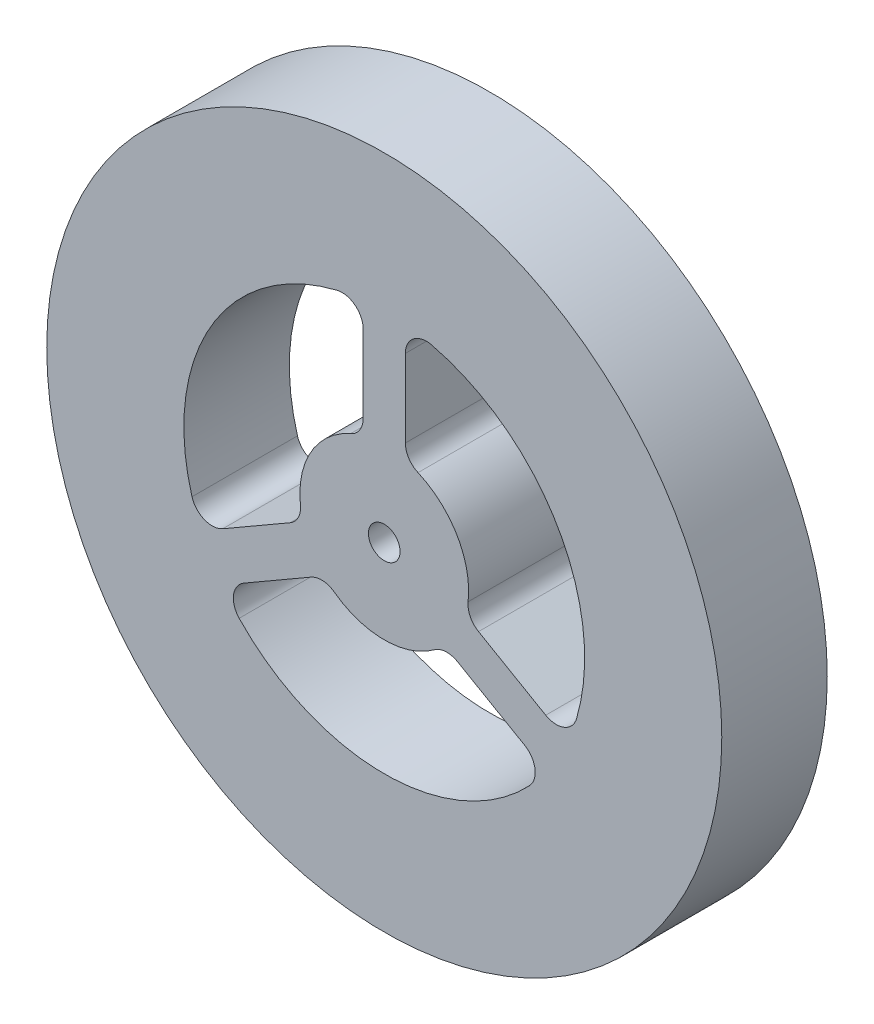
from build123d import *

# Parameters (mm, degrees)
SKETCH_1_R      = 16
SKETCH_1_R_2    = 0.75
EXTRUDE_1_DEPTH = 5


with BuildPart() as part:
    # Sketch 1 → Extrude 1 (new body)
    with BuildSketch(Plane.XY):
        Circle(SKETCH_1_R)
        Circle(SKETCH_1_R_2, mode=Mode.SUBTRACT)
        with BuildLine():
            Line((1, 8.261355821), (1, 4.582575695))
            ThreePointArc((1, 4.582575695), (1.163339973, 4.034853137), (1.6, 3.666060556))
            ThreePointArc((1.6, 3.666060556), (3.464101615, 2), (3.974901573, -0.447389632))
            ThreePointArc((3.974901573, -0.447389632), (4.075955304, -1.009944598), (4.468626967, -1.425262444))
            Line((4.468626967, -1.425262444), (7.654544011, -3.264652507))
            ThreePointArc((7.654544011, -3.264652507), (8.525984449, -3.327083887), (9.11390213, -2.680818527))
            ThreePointArc((9.11390213, -2.680818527), (8.227241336, 4.75), (2.235294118, 9.233280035))
            ThreePointArc((2.235294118, 9.233280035), (1.381653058, 9.047261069), (1, 8.261355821))
        make_face(mode=Mode.SUBTRACT)
        with BuildLine():
            Line((3.468626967, -3.157313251), (6.654544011, -4.996703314))
            ThreePointArc((6.654544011, -4.996703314), (7.144331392, -5.720177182), (6.878608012, -6.552461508))
            ThreePointArc((6.878608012, -6.552461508), (0, -9.5), (-6.878608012, -6.552461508))
            ThreePointArc((-6.878608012, -6.552461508), (-7.144331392, -5.720177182), (-6.654544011, -4.996703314))
            Line((-6.654544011, -4.996703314), (-3.468626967, -3.157313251))
            ThreePointArc((-3.468626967, -3.157313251), (-2.912615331, -3.024908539), (-2.374901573, -3.218670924))
            ThreePointArc((-2.374901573, -3.218670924), (0, -4), (2.374901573, -3.218670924))
            ThreePointArc((2.374901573, -3.218670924), (2.912615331, -3.024908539), (3.468626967, -3.157313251))
        make_face(mode=Mode.SUBTRACT)
        with BuildLine():
            Line((-7.654544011, -3.264652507), (-4.468626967, -1.425262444))
            ThreePointArc((-4.468626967, -1.425262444), (-4.075955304, -1.009944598), (-3.974901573, -0.447389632))
            ThreePointArc((-3.974901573, -0.447389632), (-3.464101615, 2), (-1.6, 3.666060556))
            ThreePointArc((-1.6, 3.666060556), (-1.163339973, 4.034853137), (-1, 4.582575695))
            Line((-1, 4.582575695), (-1, 8.261355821))
            ThreePointArc((-1, 8.261355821), (-1.381653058, 9.047261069), (-2.235294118, 9.233280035))
            ThreePointArc((-2.235294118, 9.233280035), (-8.227241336, 4.75), (-9.11390213, -2.680818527))
            ThreePointArc((-9.11390213, -2.680818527), (-8.525984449, -3.327083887), (-7.654544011, -3.264652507))
        make_face(mode=Mode.SUBTRACT)
    extrude(amount=EXTRUDE_1_DEPTH)


solid = part.part
